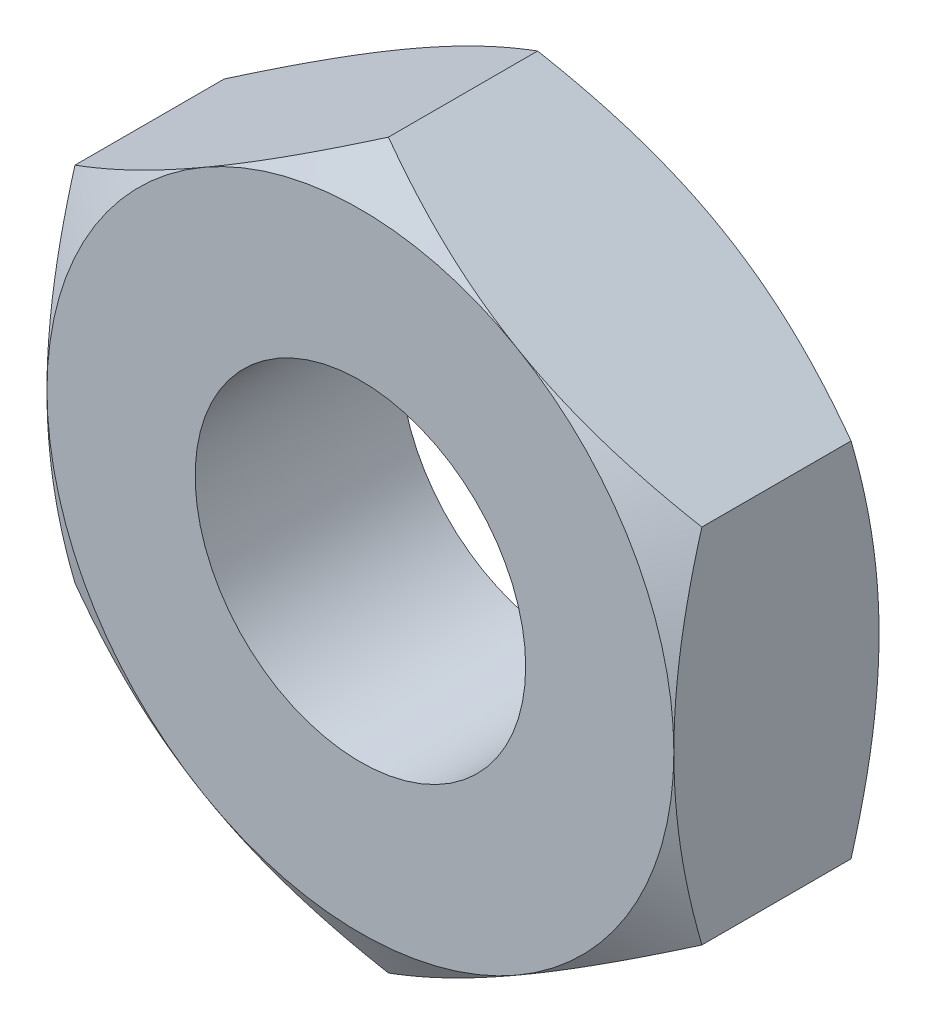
from build123d import *

# Parameters (mm, degrees)
BASENUT_DEPTH           = 1.8
TROU_TARAUD_M3_5X0_61_D = 2.9


with BuildPart() as part:
    # BaseNutSke → BaseNut (new body)
    with BuildSketch(Plane.XY):
        Polygon((2.75, 1.58771324), (2.75, -1.58771324), (0, -3.175426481), (-2.75, -1.58771324), (-2.75, 1.58771324), (0, 3.175426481), align=None)
    extrude(amount=-BASENUT_DEPTH)

    # Sketch3 → Double-Chamfer (revolve, cut)
    with BuildSketch(Plane(origin=(0, 0, 0), x_dir=(0, 0, -1), z_dir=(1, 0, 0))):
        Polygon((1.8, 2.75), (1.554379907, 3.175426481), (1.554379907, 13.175426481), (11.8, 13.175426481), (11.8, 2.75), align=None)
        Polygon((0.245620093, 13.175426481), (-10, 13.175426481), (-10, 2.75), (0, 2.75), (0.245620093, 3.175426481), align=None)
    revolve(axis=Axis((0, 0, 0), (0, 0, -1)), mode=Mode.SUBTRACT)

    # Trou taraud_ M3.5x0.61 (through all)
    with Locations(Plane.XY):
        with Locations((0, 0)):
            Hole(TROU_TARAUD_M3_5X0_61_D / 2)


solid = part.part
